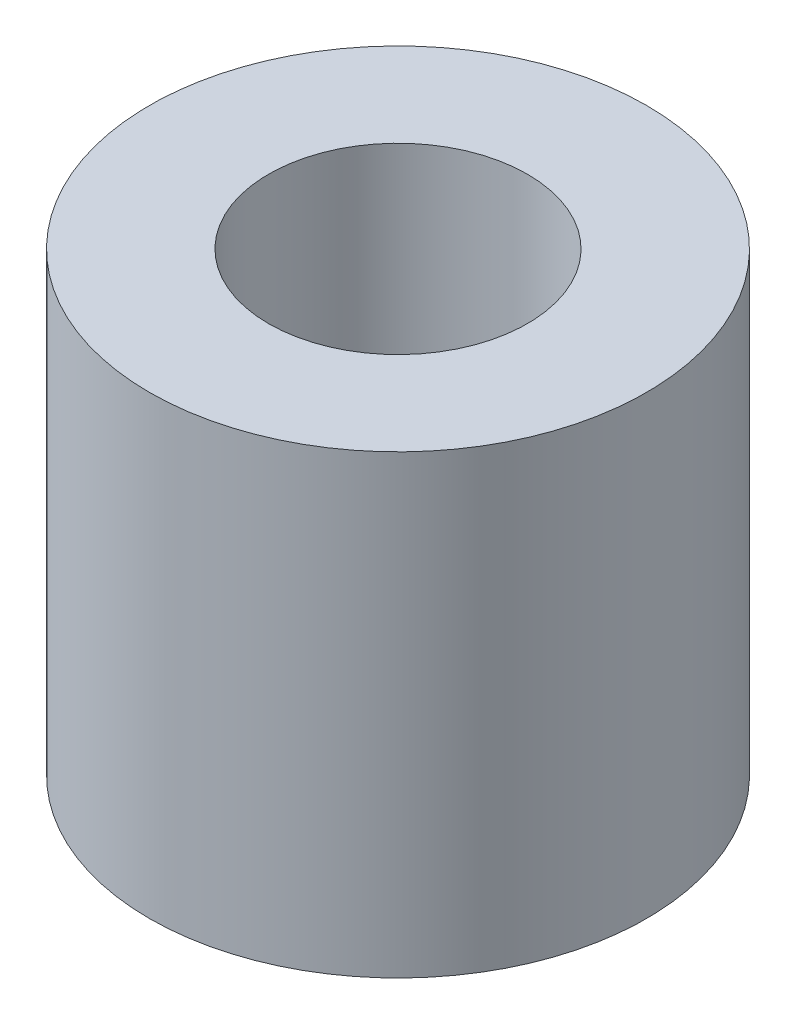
ISO-10303-21;
HEADER;
FILE_DESCRIPTION(('STEP AP214'),'2;1');
FILE_NAME('part.step','',(''),(''),'','','');
FILE_SCHEMA(('AUTOMOTIVE_DESIGN { 1 0 10303 214 1 1 1 1 }'));
ENDSEC;
DATA;
#1=APPLICATION_CONTEXT('core data for automotive mechanical design processes');
#2=APPLICATION_PROTOCOL_DEFINITION('international standard','automotive_design',2000,#1);
#3=PRODUCT_CONTEXT('',#1,'mechanical');
#4=PRODUCT('Part','Part','',(#3));
#5=PRODUCT_RELATED_PRODUCT_CATEGORY('part','',(#4));
#6=PRODUCT_DEFINITION_FORMATION('','',#4);
#7=PRODUCT_DEFINITION_CONTEXT('part definition',#1,'design');
#8=PRODUCT_DEFINITION('design','',#6,#7);
#9=PRODUCT_DEFINITION_SHAPE('','',#8);
#10=(LENGTH_UNIT() NAMED_UNIT(*) SI_UNIT(.MILLI.,.METRE.));
#11=(NAMED_UNIT(*) PLANE_ANGLE_UNIT() SI_UNIT($,.RADIAN.));
#12=(NAMED_UNIT(*) SI_UNIT($,.STERADIAN.) SOLID_ANGLE_UNIT());
#13=UNCERTAINTY_MEASURE_WITH_UNIT(LENGTH_MEASURE(1.E-05),#10,'distance_accuracy_value','');
#14=(GEOMETRIC_REPRESENTATION_CONTEXT(3) GLOBAL_UNCERTAINTY_ASSIGNED_CONTEXT((#13)) GLOBAL_UNIT_ASSIGNED_CONTEXT((#10,
#11,#12)) REPRESENTATION_CONTEXT('',''));
#15=CARTESIAN_POINT('',(0.,0.,0.));
#16=DIRECTION('',(0.,0.,1.));
#17=DIRECTION('',(1.,0.,0.));
#18=AXIS2_PLACEMENT_3D('',#15,#16,#17);
#19=CARTESIAN_POINT('',(0.,0.,0.));
#20=DIRECTION('',(0.,-1.,0.));
#21=DIRECTION('',(0.,0.,-1.));
#22=AXIS2_PLACEMENT_3D('',#19,#20,#21);
#23=CYLINDRICAL_SURFACE('',#22,1.5875);
#24=CARTESIAN_POINT('',(0.,5.588,0.));
#25=DIRECTION('',(0.,-1.,0.));
#26=DIRECTION('',(0.,0.,-1.));
#27=AXIS2_PLACEMENT_3D('',#24,#25,#26);
#28=CIRCLE('',#27,1.5875);
#29=CARTESIAN_POINT('',(0.,5.588,-1.5875));
#30=VERTEX_POINT('',#29);
#31=EDGE_CURVE('E46',#30,#30,#28,.T.);
#32=ORIENTED_EDGE('',*,*,#31,.F.);
#33=EDGE_LOOP('',(#32));
#34=FACE_BOUND('',#33,.T.);
#35=CARTESIAN_POINT('',(0.,0.,0.));
#36=DIRECTION('',(0.,-1.,0.));
#37=DIRECTION('',(0.,0.,-1.));
#38=AXIS2_PLACEMENT_3D('',#35,#36,#37);
#39=CIRCLE('',#38,1.5875);
#40=CARTESIAN_POINT('',(0.,0.,-1.5875));
#41=VERTEX_POINT('',#40);
#42=EDGE_CURVE('E10',#41,#41,#39,.T.);
#43=ORIENTED_EDGE('',*,*,#42,.T.);
#44=EDGE_LOOP('',(#43));
#45=FACE_BOUND('',#44,.T.);
#46=ADVANCED_FACE('F32',(#34,#45),#23,.F.);
#47=CARTESIAN_POINT('',(-1.5875,0.,0.));
#48=DIRECTION('',(0.,1.,0.));
#49=DIRECTION('',(0.,0.,1.));
#50=AXIS2_PLACEMENT_3D('',#47,#48,#49);
#51=PLANE('',#50);
#52=ORIENTED_EDGE('',*,*,#42,.F.);
#53=EDGE_LOOP('',(#52));
#54=FACE_BOUND('',#53,.T.);
#55=CARTESIAN_POINT('',(0.,0.,0.));
#56=DIRECTION('',(0.,-1.,0.));
#57=DIRECTION('',(0.,0.,-1.));
#58=AXIS2_PLACEMENT_3D('',#55,#56,#57);
#59=CIRCLE('',#58,3.048);
#60=CARTESIAN_POINT('',(0.,0.,-3.048));
#61=VERTEX_POINT('',#60);
#62=EDGE_CURVE('E38',#61,#61,#59,.T.);
#63=ORIENTED_EDGE('',*,*,#62,.T.);
#64=EDGE_LOOP('',(#63));
#65=FACE_BOUND('',#64,.T.);
#66=ADVANCED_FACE('F55',(#54,#65),#51,.F.);
#67=CARTESIAN_POINT('',(0.,0.,0.));
#68=DIRECTION('',(0.,-1.,0.));
#69=DIRECTION('',(0.,0.,-1.));
#70=AXIS2_PLACEMENT_3D('',#67,#68,#69);
#71=CYLINDRICAL_SURFACE('',#70,3.048);
#72=ORIENTED_EDGE('',*,*,#62,.F.);
#73=EDGE_LOOP('',(#72));
#74=FACE_BOUND('',#73,.T.);
#75=CARTESIAN_POINT('',(0.,5.588,0.));
#76=DIRECTION('',(0.,-1.,0.));
#77=DIRECTION('',(0.,0.,-1.));
#78=AXIS2_PLACEMENT_3D('',#75,#76,#77);
#79=CIRCLE('',#78,3.048);
#80=CARTESIAN_POINT('',(0.,5.588,-3.048));
#81=VERTEX_POINT('',#80);
#82=EDGE_CURVE('E42',#81,#81,#79,.T.);
#83=ORIENTED_EDGE('',*,*,#82,.T.);
#84=EDGE_LOOP('',(#83));
#85=FACE_BOUND('',#84,.T.);
#86=ADVANCED_FACE('F59',(#74,#85),#71,.T.);
#87=CARTESIAN_POINT('',(-3.048,5.588,0.));
#88=DIRECTION('',(0.,-1.,0.));
#89=DIRECTION('',(0.,0.,-1.));
#90=AXIS2_PLACEMENT_3D('',#87,#88,#89);
#91=PLANE('',#90);
#92=ORIENTED_EDGE('',*,*,#82,.F.);
#93=EDGE_LOOP('',(#92));
#94=FACE_BOUND('',#93,.T.);
#95=ORIENTED_EDGE('',*,*,#31,.T.);
#96=EDGE_LOOP('',(#95));
#97=FACE_BOUND('',#96,.T.);
#98=ADVANCED_FACE('F52',(#94,#97),#91,.F.);
#99=CLOSED_SHELL('',(#46,#66,#86,#98));
#100=MANIFOLD_SOLID_BREP('B2',#99);
#101=ADVANCED_BREP_SHAPE_REPRESENTATION('',(#18,#100),#14);
#102=SHAPE_DEFINITION_REPRESENTATION(#9,#101);
ENDSEC;
END-ISO-10303-21;
